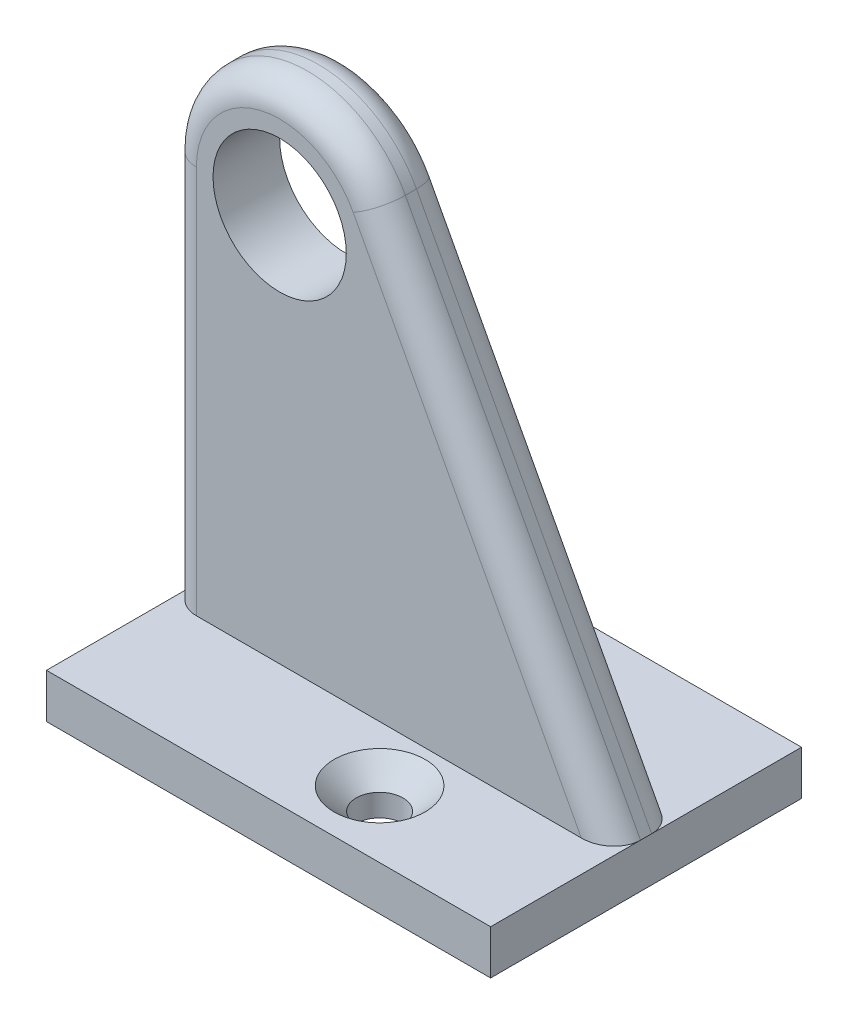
from build123d import *

# Parameters (mm, degrees)
BOSS_EXTRU_1_DEPTH                           = 6
ESQUISSE2_W                                  = 40
ESQUISSE2_H                                  = 4
BOSS_EXTRU_2_DEPTH                           = 11
ESQUISSE3_W                                  = 40
ESQUISSE3_H                                  = 4
BOSS_EXTRU_3_DEPTH                           = 11
FRAISAGE_POUR_VIS_T_TE_FRAIS_E_M3_52_A_COUNT = 2
FRAISAGE_POUR_VIS_T_TE_FRAIS_E_M3_52_A_PITCH = 24.083189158
DIAM_TRE_DU_PER_AGE_12_0_12_1_D              = 12
DIAM_TRE_DU_PER_AGE_12_0_12_1_DEPTH          = 17
CONG_1_R                                     = 2.5


with BuildPart() as part:
    # Esquisse1 → Boss.-Extru.1 (new body)
    with BuildSketch(Plane.XY.offset(3)):
        with BuildLine():
            Line((-20, 35), (-20, -4))
            Line((-20, -4), (20, -4))
            Line((20, -4), (20, 0))
            Line((20, 0), (-1.176470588, 39.705882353))
            ThreePointArc((-1.176470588, 39.705882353), (-12.42535625, 44.701425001), (-20, 35))
        make_face()
    extrude(amount=-BOSS_EXTRU_1_DEPTH)

    # Esquisse2 → Boss.-Extru.2 (add)
    with BuildSketch(Plane.XY.offset(3)):
        with Locations((0, -2)):
            Rectangle(ESQUISSE2_W, ESQUISSE2_H)
    extrude(amount=BOSS_EXTRU_2_DEPTH)

    # Esquisse3 → Boss.-Extru.3 (add)
    with BuildSketch(Plane(origin=(0, 0, -3), x_dir=(-1, 0, 0), z_dir=(0, 0, -1))):
        with Locations((0, -2)):
            Rectangle(ESQUISSE3_W, ESQUISSE3_H)
    extrude(amount=BOSS_EXTRU_3_DEPTH)

    # Esquisse4 → Fraisage pour vis _ t_te frais_e M3.52 (revolve, cut)
    with BuildSketch(Plane(origin=(-14, 0, -8), x_dir=(0, 0, 1), z_dir=(1, 0, 0))):
        Polygon((0, 0), (0, 4), (2.1, 4), (2.1, 2), (4.1, 0), align=None)
    fraisage_pour_vis_t_te_frais_e_m3_52 = revolve(axis=Axis((-14, 6.35, -8), (0, -1, 0)), mode=Mode.SUBTRACT)

    # Fraisage pour vis _ t_te frais_e M3.52 a: Fraisage pour vis _ t_te frais_e M3.52 ×2
    with Locations(*[Vector(0.7474093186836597, 0, 0.6643638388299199) * (i * FRAISAGE_POUR_VIS_T_TE_FRAIS_E_M3_52_A_PITCH) for i in range(1, FRAISAGE_POUR_VIS_T_TE_FRAIS_E_M3_52_A_COUNT)]):
        add(fraisage_pour_vis_t_te_frais_e_m3_52, mode=Mode.SUBTRACT)

    # Diam_tre du per_age _12.0 _12_1
    with Locations(Plane(origin=(0, 0, -3), x_dir=(-1, 0, 0), z_dir=(0, 0, -1))):
        with Locations((10, 35)):
            Hole(DIAM_TRE_DU_PER_AGE_12_0_12_1_D / 2, depth=DIAM_TRE_DU_PER_AGE_12_0_12_1_DEPTH)

    # Cong_1
    cong_1_edges = [part.edges().sort_by_distance(p)[0] for p in [
        (9.411764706, 19.852941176, -3),
        (-12.42535625, 44.701425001, -3),
        (9.411764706, 19.852941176, 3),
        (-20, 17.5, 3),
        (-12.42535625, 44.701425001, 3),
        (-20, 17.5, -3),
    ]]
    fillet(cong_1_edges, radius=CONG_1_R)


solid = part.part
